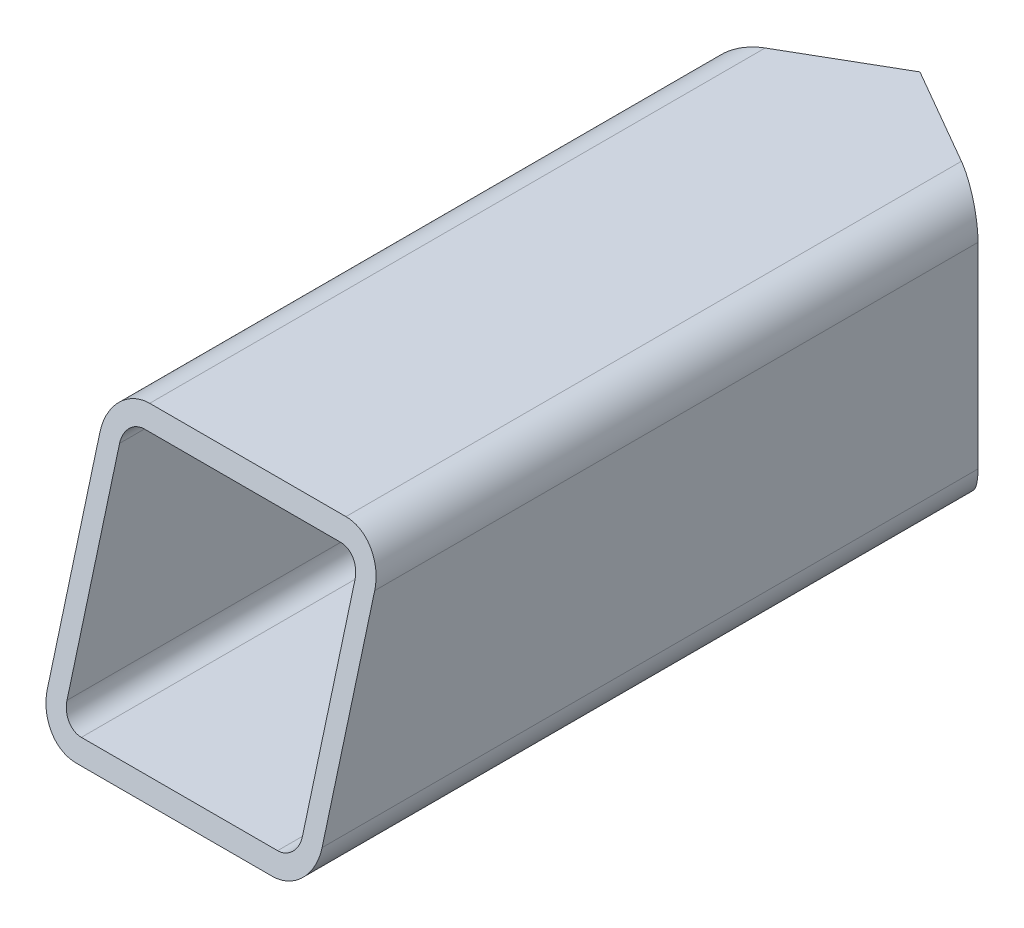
ISO-10303-21;
HEADER;
FILE_DESCRIPTION(('STEP AP214'),'2;1');
FILE_NAME('part.step','',(''),(''),'','','');
FILE_SCHEMA(('AUTOMOTIVE_DESIGN { 1 0 10303 214 1 1 1 1 }'));
ENDSEC;
DATA;
#1=APPLICATION_CONTEXT('core data for automotive mechanical design processes');
#2=APPLICATION_PROTOCOL_DEFINITION('international standard','automotive_design',2000,#1);
#3=PRODUCT_CONTEXT('',#1,'mechanical');
#4=PRODUCT('Part','Part','',(#3));
#5=PRODUCT_RELATED_PRODUCT_CATEGORY('part','',(#4));
#6=PRODUCT_DEFINITION_FORMATION('','',#4);
#7=PRODUCT_DEFINITION_CONTEXT('part definition',#1,'design');
#8=PRODUCT_DEFINITION('design','',#6,#7);
#9=PRODUCT_DEFINITION_SHAPE('','',#8);
#10=(LENGTH_UNIT() NAMED_UNIT(*) SI_UNIT(.MILLI.,.METRE.));
#11=(NAMED_UNIT(*) PLANE_ANGLE_UNIT() SI_UNIT($,.RADIAN.));
#12=(NAMED_UNIT(*) SI_UNIT($,.STERADIAN.) SOLID_ANGLE_UNIT());
#13=UNCERTAINTY_MEASURE_WITH_UNIT(LENGTH_MEASURE(1.E-05),#10,'distance_accuracy_value','');
#14=(GEOMETRIC_REPRESENTATION_CONTEXT(3) GLOBAL_UNCERTAINTY_ASSIGNED_CONTEXT((#13)) GLOBAL_UNIT_ASSIGNED_CONTEXT((#10,
#11,#12)) REPRESENTATION_CONTEXT('',''));
#15=CARTESIAN_POINT('',(0.,0.,0.));
#16=DIRECTION('',(0.,0.,1.));
#17=DIRECTION('',(1.,0.,0.));
#18=AXIS2_PLACEMENT_3D('',#15,#16,#17);
#19=CARTESIAN_POINT('',(-25.,25.,250.));
#20=DIRECTION('',(0.,0.,-1.));
#21=DIRECTION('',(-1.,0.,0.));
#22=AXIS2_PLACEMENT_3D('',#19,#20,#21);
#23=CYLINDRICAL_SURFACE('',#22,10.);
#24=DIRECTION('',(0.,0.,-1.));
#25=VECTOR('',#24,1.);
#26=CARTESIAN_POINT('',(-35.,25.,250.));
#27=LINE('',#26,#25);
#28=CARTESIAN_POINT('',(-35.,25.,173.923048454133));
#29=VERTEX_POINT('',#28);
#30=CARTESIAN_POINT('',(-35.,25.,20.207259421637));
#31=VERTEX_POINT('',#30);
#32=EDGE_CURVE('E176',#29,#31,#27,.T.);
#33=ORIENTED_EDGE('',*,*,#32,.F.);
#34=CARTESIAN_POINT('',(-25.,25.,173.923048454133));
#35=DIRECTION('',(0.,-0.258819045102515,-0.96592582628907));
#36=DIRECTION('',(0.,0.96592582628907,-0.258819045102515));
#37=AXIS2_PLACEMENT_3D('',#34,#35,#36);
#38=ELLIPSE('',#37,10.3527618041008,10.);
#39=CARTESIAN_POINT('',(-25.,35.,171.243556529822));
#40=VERTEX_POINT('',#39);
#41=EDGE_CURVE('E160',#29,#40,#38,.T.);
#42=ORIENTED_EDGE('',*,*,#41,.T.);
#43=DIRECTION('',(0.,0.,-1.));
#44=VECTOR('',#43,1.);
#45=CARTESIAN_POINT('',(-25.,35.,250.));
#46=LINE('',#45,#44);
#47=CARTESIAN_POINT('',(-25.,35.,14.4337567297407));
#48=VERTEX_POINT('',#47);
#49=EDGE_CURVE('E245',#40,#48,#46,.T.);
#50=ORIENTED_EDGE('',*,*,#49,.T.);
#51=CARTESIAN_POINT('',(-25.,25.,14.4337567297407));
#52=DIRECTION('',(-0.500000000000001,0.,-0.866025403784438));
#53=DIRECTION('',(0.866025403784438,0.,-0.500000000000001));
#54=AXIS2_PLACEMENT_3D('',#51,#52,#53);
#55=ELLIPSE('',#54,11.5470053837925,10.);
#56=EDGE_CURVE('E291',#31,#48,#55,.T.);
#57=ORIENTED_EDGE('',*,*,#56,.F.);
#58=EDGE_LOOP('',(#33,#42,#50,#57));
#59=FACE_BOUND('',#58,.T.);
#60=ADVANCED_FACE('F32',(#59),#23,.T.);
#61=CARTESIAN_POINT('',(-25.,-25.,250.));
#62=DIRECTION('',(0.,0.,-1.));
#63=DIRECTION('',(-1.,0.,0.));
#64=AXIS2_PLACEMENT_3D('',#61,#62,#63);
#65=CYLINDRICAL_SURFACE('',#64,10.);
#66=DIRECTION('',(0.,0.,-1.));
#67=VECTOR('',#66,1.);
#68=CARTESIAN_POINT('',(-25.,-35.,250.));
#69=LINE('',#68,#67);
#70=CARTESIAN_POINT('',(-25.,-35.,190.));
#71=VERTEX_POINT('',#70);
#72=CARTESIAN_POINT('',(-25.,-35.,14.4337567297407));
#73=VERTEX_POINT('',#72);
#74=EDGE_CURVE('E170',#71,#73,#69,.T.);
#75=ORIENTED_EDGE('',*,*,#74,.F.);
#76=CARTESIAN_POINT('',(-25.,-25.,187.320508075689));
#77=DIRECTION('',(0.,-0.258819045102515,-0.96592582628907));
#78=DIRECTION('',(0.,0.96592582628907,-0.258819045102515));
#79=AXIS2_PLACEMENT_3D('',#76,#77,#78);
#80=ELLIPSE('',#79,10.3527618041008,10.);
#81=CARTESIAN_POINT('',(-35.,-25.,187.320508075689));
#82=VERTEX_POINT('',#81);
#83=EDGE_CURVE('E157',#71,#82,#80,.T.);
#84=ORIENTED_EDGE('',*,*,#83,.T.);
#85=DIRECTION('',(0.,0.,-1.));
#86=VECTOR('',#85,1.);
#87=CARTESIAN_POINT('',(-35.,-25.,250.));
#88=LINE('',#87,#86);
#89=CARTESIAN_POINT('',(-35.,-25.,20.207259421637));
#90=VERTEX_POINT('',#89);
#91=EDGE_CURVE('E168',#82,#90,#88,.T.);
#92=ORIENTED_EDGE('',*,*,#91,.T.);
#93=CARTESIAN_POINT('',(-25.,-25.,14.4337567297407));
#94=DIRECTION('',(-0.500000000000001,0.,-0.866025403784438));
#95=DIRECTION('',(0.866025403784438,0.,-0.500000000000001));
#96=AXIS2_PLACEMENT_3D('',#93,#94,#95);
#97=ELLIPSE('',#96,11.5470053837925,10.);
#98=EDGE_CURVE('E207',#73,#90,#97,.T.);
#99=ORIENTED_EDGE('',*,*,#98,.F.);
#100=EDGE_LOOP('',(#75,#84,#92,#99));
#101=FACE_BOUND('',#100,.T.);
#102=ADVANCED_FACE('F166',(#101),#65,.T.);
#103=CARTESIAN_POINT('',(-25.,-35.,250.));
#104=DIRECTION('',(0.,1.,0.));
#105=DIRECTION('',(0.,0.,1.));
#106=AXIS2_PLACEMENT_3D('',#103,#104,#105);
#107=PLANE('',#106);
#108=DIRECTION('',(0.,0.,-1.));
#109=VECTOR('',#108,1.);
#110=CARTESIAN_POINT('',(25.,-35.,250.));
#111=LINE('',#110,#109);
#112=CARTESIAN_POINT('',(25.,-35.,190.));
#113=VERTEX_POINT('',#112);
#114=CARTESIAN_POINT('',(25.,-35.,14.4337567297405));
#115=VERTEX_POINT('',#114);
#116=EDGE_CURVE('E180',#113,#115,#111,.T.);
#117=ORIENTED_EDGE('',*,*,#116,.F.);
#118=DIRECTION('',(-1.,0.,0.));
#119=VECTOR('',#118,1.);
#120=CARTESIAN_POINT('',(-25.,-35.,190.));
#121=LINE('',#120,#119);
#122=EDGE_CURVE('E318',#113,#71,#121,.T.);
#123=ORIENTED_EDGE('',*,*,#122,.T.);
#124=ORIENTED_EDGE('',*,*,#74,.T.);
#125=DIRECTION('',(-0.866025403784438,0.,0.500000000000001));
#126=VECTOR('',#125,1.);
#127=CARTESIAN_POINT('',(-127.003175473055,-35.,73.3253175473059));
#128=LINE('',#127,#126);
#129=CARTESIAN_POINT('',(0.,-35.,0.));
#130=VERTEX_POINT('',#129);
#131=EDGE_CURVE('E211',#130,#73,#128,.T.);
#132=ORIENTED_EDGE('',*,*,#131,.F.);
#133=DIRECTION('',(-0.866025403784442,0.,-0.499999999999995));
#134=VECTOR('',#133,1.);
#135=CARTESIAN_POINT('',(89.5031754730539,-35.,51.6746824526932));
#136=LINE('',#135,#134);
#137=EDGE_CURVE('E227',#115,#130,#136,.T.);
#138=ORIENTED_EDGE('',*,*,#137,.F.);
#139=EDGE_LOOP('',(#117,#123,#124,#132,#138));
#140=FACE_BOUND('',#139,.T.);
#141=ADVANCED_FACE('F262',(#140),#107,.F.);
#142=CARTESIAN_POINT('',(25.,-25.,250.));
#143=DIRECTION('',(0.,0.,-1.));
#144=DIRECTION('',(-1.,0.,0.));
#145=AXIS2_PLACEMENT_3D('',#142,#143,#144);
#146=CYLINDRICAL_SURFACE('',#145,10.);
#147=DIRECTION('',(0.,0.,-1.));
#148=VECTOR('',#147,1.);
#149=CARTESIAN_POINT('',(35.,-25.,250.));
#150=LINE('',#149,#148);
#151=CARTESIAN_POINT('',(35.,-25.,187.320508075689));
#152=VERTEX_POINT('',#151);
#153=CARTESIAN_POINT('',(35.,-25.,20.2072594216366));
#154=VERTEX_POINT('',#153);
#155=EDGE_CURVE('E251',#152,#154,#150,.T.);
#156=ORIENTED_EDGE('',*,*,#155,.F.);
#157=CARTESIAN_POINT('',(25.,-25.,187.320508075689));
#158=DIRECTION('',(0.,-0.258819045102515,-0.96592582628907));
#159=DIRECTION('',(0.,0.96592582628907,-0.258819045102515));
#160=AXIS2_PLACEMENT_3D('',#157,#158,#159);
#161=ELLIPSE('',#160,10.3527618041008,10.);
#162=EDGE_CURVE('E260',#152,#113,#161,.T.);
#163=ORIENTED_EDGE('',*,*,#162,.T.);
#164=ORIENTED_EDGE('',*,*,#116,.T.);
#165=CARTESIAN_POINT('',(25.,-25.,14.4337567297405));
#166=DIRECTION('',(0.499999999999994,0.,-0.866025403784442));
#167=DIRECTION('',(-0.866025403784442,0.,-0.499999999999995));
#168=AXIS2_PLACEMENT_3D('',#165,#166,#167);
#169=ELLIPSE('',#168,11.5470053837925,10.);
#170=EDGE_CURVE('E225',#154,#115,#169,.T.);
#171=ORIENTED_EDGE('',*,*,#170,.F.);
#172=EDGE_LOOP('',(#156,#163,#164,#171));
#173=FACE_BOUND('',#172,.T.);
#174=ADVANCED_FACE('F258',(#173),#146,.T.);
#175=CARTESIAN_POINT('',(35.,25.,250.));
#176=DIRECTION('',(-1.,0.,0.));
#177=DIRECTION('',(0.,-1.,0.));
#178=AXIS2_PLACEMENT_3D('',#175,#176,#177);
#179=PLANE('',#178);
#180=DIRECTION('',(0.,0.,-1.));
#181=VECTOR('',#180,1.);
#182=CARTESIAN_POINT('',(35.,25.,250.));
#183=LINE('',#182,#181);
#184=CARTESIAN_POINT('',(35.,25.,173.923048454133));
#185=VERTEX_POINT('',#184);
#186=CARTESIAN_POINT('',(35.,25.,20.2072594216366));
#187=VERTEX_POINT('',#186);
#188=EDGE_CURVE('E249',#185,#187,#183,.T.);
#189=ORIENTED_EDGE('',*,*,#188,.F.);
#190=DIRECTION('',(0.,-0.96592582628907,0.258819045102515));
#191=VECTOR('',#190,1.);
#192=CARTESIAN_POINT('',(35.,5.98076211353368,179.019237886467));
#193=LINE('',#192,#191);
#194=EDGE_CURVE('E321',#185,#152,#193,.T.);
#195=ORIENTED_EDGE('',*,*,#194,.T.);
#196=ORIENTED_EDGE('',*,*,#155,.T.);
#197=DIRECTION('',(0.,-1.,0.));
#198=VECTOR('',#197,1.);
#199=CARTESIAN_POINT('',(34.9999999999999,383.608241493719,20.2072594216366));
#200=LINE('',#199,#198);
#201=EDGE_CURVE('E267',#187,#154,#200,.T.);
#202=ORIENTED_EDGE('',*,*,#201,.F.);
#203=EDGE_LOOP('',(#189,#195,#196,#202));
#204=FACE_BOUND('',#203,.T.);
#205=ADVANCED_FACE('F414',(#204),#179,.F.);
#206=CARTESIAN_POINT('',(25.,25.,250.));
#207=DIRECTION('',(0.,0.,-1.));
#208=DIRECTION('',(-1.,0.,0.));
#209=AXIS2_PLACEMENT_3D('',#206,#207,#208);
#210=CYLINDRICAL_SURFACE('',#209,10.);
#211=DIRECTION('',(0.,0.,-1.));
#212=VECTOR('',#211,1.);
#213=CARTESIAN_POINT('',(25.,35.,250.));
#214=LINE('',#213,#212);
#215=CARTESIAN_POINT('',(25.,35.,171.243556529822));
#216=VERTEX_POINT('',#215);
#217=CARTESIAN_POINT('',(25.,35.,14.4337567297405));
#218=VERTEX_POINT('',#217);
#219=EDGE_CURVE('E247',#216,#218,#214,.T.);
#220=ORIENTED_EDGE('',*,*,#219,.F.);
#221=CARTESIAN_POINT('',(25.,25.,173.923048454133));
#222=DIRECTION('',(0.,-0.258819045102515,-0.96592582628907));
#223=DIRECTION('',(0.,0.96592582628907,-0.258819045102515));
#224=AXIS2_PLACEMENT_3D('',#221,#222,#223);
#225=ELLIPSE('',#224,10.3527618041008,10.);
#226=EDGE_CURVE('E324',#216,#185,#225,.T.);
#227=ORIENTED_EDGE('',*,*,#226,.T.);
#228=ORIENTED_EDGE('',*,*,#188,.T.);
#229=CARTESIAN_POINT('',(25.,25.,14.4337567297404));
#230=DIRECTION('',(0.499999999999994,0.,-0.866025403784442));
#231=DIRECTION('',(-0.866025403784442,0.,-0.499999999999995));
#232=AXIS2_PLACEMENT_3D('',#229,#230,#231);
#233=ELLIPSE('',#232,11.5470053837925,10.);
#234=EDGE_CURVE('E222',#218,#187,#233,.T.);
#235=ORIENTED_EDGE('',*,*,#234,.F.);
#236=EDGE_LOOP('',(#220,#227,#228,#235));
#237=FACE_BOUND('',#236,.T.);
#238=ADVANCED_FACE('F422',(#237),#210,.T.);
#239=CARTESIAN_POINT('',(-25.,35.,250.));
#240=DIRECTION('',(0.,-1.,0.));
#241=DIRECTION('',(1.,0.,0.));
#242=AXIS2_PLACEMENT_3D('',#239,#240,#241);
#243=PLANE('',#242);
#244=ORIENTED_EDGE('',*,*,#49,.F.);
#245=DIRECTION('',(1.,0.,0.));
#246=VECTOR('',#245,1.);
#247=CARTESIAN_POINT('',(-25.,35.,171.243556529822));
#248=LINE('',#247,#246);
#249=EDGE_CURVE('E327',#40,#216,#248,.T.);
#250=ORIENTED_EDGE('',*,*,#249,.T.);
#251=ORIENTED_EDGE('',*,*,#219,.T.);
#252=DIRECTION('',(0.866025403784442,0.,0.499999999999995));
#253=VECTOR('',#252,1.);
#254=CARTESIAN_POINT('',(89.5031754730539,35.,51.6746824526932));
#255=LINE('',#254,#253);
#256=CARTESIAN_POINT('',(0.,35.0000000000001,0.));
#257=VERTEX_POINT('',#256);
#258=EDGE_CURVE('E220',#257,#218,#255,.T.);
#259=ORIENTED_EDGE('',*,*,#258,.F.);
#260=DIRECTION('',(0.866025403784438,0.,-0.500000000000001));
#261=VECTOR('',#260,1.);
#262=CARTESIAN_POINT('',(-127.003175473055,35.,73.3253175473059));
#263=LINE('',#262,#261);
#264=EDGE_CURVE('E288',#48,#257,#263,.T.);
#265=ORIENTED_EDGE('',*,*,#264,.F.);
#266=EDGE_LOOP('',(#244,#250,#251,#259,#265));
#267=FACE_BOUND('',#266,.T.);
#268=ADVANCED_FACE('F335',(#267),#243,.F.);
#269=CARTESIAN_POINT('',(-25.,25.,250.));
#270=DIRECTION('',(0.,0.,-1.));
#271=DIRECTION('',(-1.,0.,0.));
#272=AXIS2_PLACEMENT_3D('',#269,#270,#271);
#273=CYLINDRICAL_SURFACE('',#272,5.);
#274=CARTESIAN_POINT('',(-25.,25.,173.923048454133));
#275=DIRECTION('',(0.,-0.258819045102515,-0.96592582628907));
#276=DIRECTION('',(0.,0.96592582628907,-0.258819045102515));
#277=AXIS2_PLACEMENT_3D('',#274,#275,#276);
#278=ELLIPSE('',#277,5.17638090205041,5.);
#279=CARTESIAN_POINT('',(-30.,25.,173.923048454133));
#280=VERTEX_POINT('',#279);
#281=CARTESIAN_POINT('',(-25.,30.,172.583302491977));
#282=VERTEX_POINT('',#281);
#283=EDGE_CURVE('E46',#280,#282,#278,.T.);
#284=ORIENTED_EDGE('',*,*,#283,.F.);
#285=DIRECTION('',(0.,0.,-1.));
#286=VECTOR('',#285,1.);
#287=CARTESIAN_POINT('',(-30.,25.,250.));
#288=LINE('',#287,#286);
#289=CARTESIAN_POINT('',(-30.,25.,17.3205080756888));
#290=VERTEX_POINT('',#289);
#291=EDGE_CURVE('E243',#280,#290,#288,.T.);
#292=ORIENTED_EDGE('',*,*,#291,.T.);
#293=CARTESIAN_POINT('',(-25.,25.,14.4337567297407));
#294=DIRECTION('',(-0.500000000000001,0.,-0.866025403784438));
#295=DIRECTION('',(0.866025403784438,0.,-0.500000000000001));
#296=AXIS2_PLACEMENT_3D('',#293,#294,#295);
#297=ELLIPSE('',#296,5.77350269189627,5.);
#298=CARTESIAN_POINT('',(-25.,30.,14.4337567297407));
#299=VERTEX_POINT('',#298);
#300=EDGE_CURVE('E271',#290,#299,#297,.T.);
#301=ORIENTED_EDGE('',*,*,#300,.T.);
#302=DIRECTION('',(0.,0.,-1.));
#303=VECTOR('',#302,1.);
#304=CARTESIAN_POINT('',(-25.,30.,250.));
#305=LINE('',#304,#303);
#306=EDGE_CURVE('E230',#282,#299,#305,.T.);
#307=ORIENTED_EDGE('',*,*,#306,.F.);
#308=EDGE_LOOP('',(#284,#292,#301,#307));
#309=FACE_BOUND('',#308,.T.);
#310=ADVANCED_FACE('F339',(#309),#273,.F.);
#311=CARTESIAN_POINT('',(-30.,25.,250.));
#312=DIRECTION('',(1.,0.,0.));
#313=DIRECTION('',(0.,1.,0.));
#314=AXIS2_PLACEMENT_3D('',#311,#312,#313);
#315=PLANE('',#314);
#316=DIRECTION('',(0.,0.96592582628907,-0.258819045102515));
#317=VECTOR('',#316,1.);
#318=CARTESIAN_POINT('',(-30.,5.98076211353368,179.019237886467));
#319=LINE('',#318,#317);
#320=CARTESIAN_POINT('',(-30.,-25.,187.320508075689));
#321=VERTEX_POINT('',#320);
#322=EDGE_CURVE('E53',#321,#280,#319,.T.);
#323=ORIENTED_EDGE('',*,*,#322,.F.);
#324=DIRECTION('',(0.,0.,-1.));
#325=VECTOR('',#324,1.);
#326=CARTESIAN_POINT('',(-30.,-25.,250.));
#327=LINE('',#326,#325);
#328=CARTESIAN_POINT('',(-30.,-25.,17.3205080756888));
#329=VERTEX_POINT('',#328);
#330=EDGE_CURVE('E241',#321,#329,#327,.T.);
#331=ORIENTED_EDGE('',*,*,#330,.T.);
#332=DIRECTION('',(0.,1.,0.));
#333=VECTOR('',#332,1.);
#334=CARTESIAN_POINT('',(-30.,24.9999999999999,17.3205080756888));
#335=LINE('',#334,#333);
#336=EDGE_CURVE('E274',#329,#290,#335,.T.);
#337=ORIENTED_EDGE('',*,*,#336,.T.);
#338=ORIENTED_EDGE('',*,*,#291,.F.);
#339=EDGE_LOOP('',(#323,#331,#337,#338));
#340=FACE_BOUND('',#339,.T.);
#341=ADVANCED_FACE('F340',(#340),#315,.T.);
#342=CARTESIAN_POINT('',(-25.,-25.,250.));
#343=DIRECTION('',(0.,0.,-1.));
#344=DIRECTION('',(-1.,0.,0.));
#345=AXIS2_PLACEMENT_3D('',#342,#343,#344);
#346=CYLINDRICAL_SURFACE('',#345,5.);
#347=CARTESIAN_POINT('',(-25.,-25.,187.320508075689));
#348=DIRECTION('',(0.,-0.258819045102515,-0.96592582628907));
#349=DIRECTION('',(0.,0.96592582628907,-0.258819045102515));
#350=AXIS2_PLACEMENT_3D('',#347,#348,#349);
#351=ELLIPSE('',#350,5.17638090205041,5.);
#352=CARTESIAN_POINT('',(-25.,-30.,188.660254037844));
#353=VERTEX_POINT('',#352);
#354=EDGE_CURVE('E300',#353,#321,#351,.T.);
#355=ORIENTED_EDGE('',*,*,#354,.F.);
#356=DIRECTION('',(0.,0.,-1.));
#357=VECTOR('',#356,1.);
#358=CARTESIAN_POINT('',(-25.,-30.,250.));
#359=LINE('',#358,#357);
#360=CARTESIAN_POINT('',(-25.,-30.,14.4337567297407));
#361=VERTEX_POINT('',#360);
#362=EDGE_CURVE('E239',#353,#361,#359,.T.);
#363=ORIENTED_EDGE('',*,*,#362,.T.);
#364=CARTESIAN_POINT('',(-25.,-25.,14.4337567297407));
#365=DIRECTION('',(-0.500000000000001,0.,-0.866025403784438));
#366=DIRECTION('',(0.866025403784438,0.,-0.500000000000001));
#367=AXIS2_PLACEMENT_3D('',#364,#365,#366);
#368=ELLIPSE('',#367,5.77350269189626,5.);
#369=EDGE_CURVE('E282',#361,#329,#368,.T.);
#370=ORIENTED_EDGE('',*,*,#369,.T.);
#371=ORIENTED_EDGE('',*,*,#330,.F.);
#372=EDGE_LOOP('',(#355,#363,#370,#371));
#373=FACE_BOUND('',#372,.T.);
#374=ADVANCED_FACE('F344',(#373),#346,.F.);
#375=CARTESIAN_POINT('',(-25.,-30.,250.));
#376=DIRECTION('',(0.,1.,0.));
#377=DIRECTION('',(-1.,0.,0.));
#378=AXIS2_PLACEMENT_3D('',#375,#376,#377);
#379=PLANE('',#378);
#380=DIRECTION('',(-1.,0.,0.));
#381=VECTOR('',#380,1.);
#382=CARTESIAN_POINT('',(-25.,-30.,188.660254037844));
#383=LINE('',#382,#381);
#384=CARTESIAN_POINT('',(25.,-30.,188.660254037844));
#385=VERTEX_POINT('',#384);
#386=EDGE_CURVE('E303',#385,#353,#383,.T.);
#387=ORIENTED_EDGE('',*,*,#386,.F.);
#388=DIRECTION('',(0.,0.,-1.));
#389=VECTOR('',#388,1.);
#390=CARTESIAN_POINT('',(25.,-30.,250.));
#391=LINE('',#390,#389);
#392=CARTESIAN_POINT('',(25.,-30.,14.4337567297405));
#393=VERTEX_POINT('',#392);
#394=EDGE_CURVE('E237',#385,#393,#391,.T.);
#395=ORIENTED_EDGE('',*,*,#394,.T.);
#396=DIRECTION('',(-0.866025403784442,0.,-0.499999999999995));
#397=VECTOR('',#396,1.);
#398=CARTESIAN_POINT('',(89.5031754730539,-30.,51.6746824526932));
#399=LINE('',#398,#397);
#400=CARTESIAN_POINT('',(0.,-29.9999999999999,0.));
#401=VERTEX_POINT('',#400);
#402=EDGE_CURVE('E217',#393,#401,#399,.T.);
#403=ORIENTED_EDGE('',*,*,#402,.T.);
#404=DIRECTION('',(-0.866025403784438,0.,0.500000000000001));
#405=VECTOR('',#404,1.);
#406=CARTESIAN_POINT('',(-127.003175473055,-30.,73.3253175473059));
#407=LINE('',#406,#405);
#408=EDGE_CURVE('E285',#401,#361,#407,.T.);
#409=ORIENTED_EDGE('',*,*,#408,.T.);
#410=ORIENTED_EDGE('',*,*,#362,.F.);
#411=EDGE_LOOP('',(#387,#395,#403,#409,#410));
#412=FACE_BOUND('',#411,.T.);
#413=ADVANCED_FACE('F346',(#412),#379,.T.);
#414=CARTESIAN_POINT('',(25.,-25.,250.));
#415=DIRECTION('',(0.,0.,-1.));
#416=DIRECTION('',(-1.,0.,0.));
#417=AXIS2_PLACEMENT_3D('',#414,#415,#416);
#418=CYLINDRICAL_SURFACE('',#417,5.);
#419=CARTESIAN_POINT('',(25.,-25.,187.320508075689));
#420=DIRECTION('',(0.,-0.258819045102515,-0.96592582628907));
#421=DIRECTION('',(0.,0.96592582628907,-0.258819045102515));
#422=AXIS2_PLACEMENT_3D('',#419,#420,#421);
#423=ELLIPSE('',#422,5.17638090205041,5.);
#424=CARTESIAN_POINT('',(30.,-25.,187.320508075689));
#425=VERTEX_POINT('',#424);
#426=EDGE_CURVE('E306',#425,#385,#423,.T.);
#427=ORIENTED_EDGE('',*,*,#426,.F.);
#428=DIRECTION('',(0.,0.,-1.));
#429=VECTOR('',#428,1.);
#430=CARTESIAN_POINT('',(30.,-25.,250.));
#431=LINE('',#430,#429);
#432=CARTESIAN_POINT('',(30.,-25.,17.3205080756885));
#433=VERTEX_POINT('',#432);
#434=EDGE_CURVE('E235',#425,#433,#431,.T.);
#435=ORIENTED_EDGE('',*,*,#434,.T.);
#436=CARTESIAN_POINT('',(25.,-25.,14.4337567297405));
#437=DIRECTION('',(0.499999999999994,0.,-0.866025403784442));
#438=DIRECTION('',(-0.866025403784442,0.,-0.499999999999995));
#439=AXIS2_PLACEMENT_3D('',#436,#437,#438);
#440=ELLIPSE('',#439,5.77350269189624,5.);
#441=EDGE_CURVE('E209',#433,#393,#440,.T.);
#442=ORIENTED_EDGE('',*,*,#441,.T.);
#443=ORIENTED_EDGE('',*,*,#394,.F.);
#444=EDGE_LOOP('',(#427,#435,#442,#443));
#445=FACE_BOUND('',#444,.T.);
#446=ADVANCED_FACE('F349',(#445),#418,.F.);
#447=CARTESIAN_POINT('',(30.,25.,250.));
#448=DIRECTION('',(-1.,0.,0.));
#449=DIRECTION('',(0.,-1.,0.));
#450=AXIS2_PLACEMENT_3D('',#447,#448,#449);
#451=PLANE('',#450);
#452=DIRECTION('',(0.,-0.96592582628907,0.258819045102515));
#453=VECTOR('',#452,1.);
#454=CARTESIAN_POINT('',(30.,5.98076211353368,179.019237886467));
#455=LINE('',#454,#453);
#456=CARTESIAN_POINT('',(30.,25.,173.923048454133));
#457=VERTEX_POINT('',#456);
#458=EDGE_CURVE('E309',#457,#425,#455,.T.);
#459=ORIENTED_EDGE('',*,*,#458,.F.);
#460=DIRECTION('',(0.,0.,-1.));
#461=VECTOR('',#460,1.);
#462=CARTESIAN_POINT('',(30.,25.,250.));
#463=LINE('',#462,#461);
#464=CARTESIAN_POINT('',(30.,25.,17.3205080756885));
#465=VERTEX_POINT('',#464);
#466=EDGE_CURVE('E233',#457,#465,#463,.T.);
#467=ORIENTED_EDGE('',*,*,#466,.T.);
#468=DIRECTION('',(0.,-1.,0.));
#469=VECTOR('',#468,1.);
#470=CARTESIAN_POINT('',(30.,25.,17.3205080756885));
#471=LINE('',#470,#469);
#472=EDGE_CURVE('E204',#465,#433,#471,.T.);
#473=ORIENTED_EDGE('',*,*,#472,.T.);
#474=ORIENTED_EDGE('',*,*,#434,.F.);
#475=EDGE_LOOP('',(#459,#467,#473,#474));
#476=FACE_BOUND('',#475,.T.);
#477=ADVANCED_FACE('F352',(#476),#451,.T.);
#478=CARTESIAN_POINT('',(25.,25.,250.));
#479=DIRECTION('',(0.,0.,-1.));
#480=DIRECTION('',(-1.,0.,0.));
#481=AXIS2_PLACEMENT_3D('',#478,#479,#480);
#482=CYLINDRICAL_SURFACE('',#481,5.);
#483=CARTESIAN_POINT('',(25.,25.,173.923048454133));
#484=DIRECTION('',(0.,-0.258819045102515,-0.96592582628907));
#485=DIRECTION('',(0.,0.96592582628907,-0.258819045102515));
#486=AXIS2_PLACEMENT_3D('',#483,#484,#485);
#487=ELLIPSE('',#486,5.17638090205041,5.);
#488=CARTESIAN_POINT('',(25.,30.,172.583302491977));
#489=VERTEX_POINT('',#488);
#490=EDGE_CURVE('E312',#489,#457,#487,.T.);
#491=ORIENTED_EDGE('',*,*,#490,.F.);
#492=DIRECTION('',(0.,0.,-1.));
#493=VECTOR('',#492,1.);
#494=CARTESIAN_POINT('',(25.,30.,250.));
#495=LINE('',#494,#493);
#496=CARTESIAN_POINT('',(25.,30.,14.4337567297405));
#497=VERTEX_POINT('',#496);
#498=EDGE_CURVE('E189',#489,#497,#495,.T.);
#499=ORIENTED_EDGE('',*,*,#498,.T.);
#500=CARTESIAN_POINT('',(25.,25.,14.4337567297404));
#501=DIRECTION('',(0.499999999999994,0.,-0.866025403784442));
#502=DIRECTION('',(-0.866025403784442,0.,-0.499999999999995));
#503=AXIS2_PLACEMENT_3D('',#500,#501,#502);
#504=ELLIPSE('',#503,5.77350269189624,5.);
#505=EDGE_CURVE('E201',#497,#465,#504,.T.);
#506=ORIENTED_EDGE('',*,*,#505,.T.);
#507=ORIENTED_EDGE('',*,*,#466,.F.);
#508=EDGE_LOOP('',(#491,#499,#506,#507));
#509=FACE_BOUND('',#508,.T.);
#510=ADVANCED_FACE('F353',(#509),#482,.F.);
#511=CARTESIAN_POINT('',(-25.,30.,250.));
#512=DIRECTION('',(0.,-1.,0.));
#513=DIRECTION('',(0.,0.,-1.));
#514=AXIS2_PLACEMENT_3D('',#511,#512,#513);
#515=PLANE('',#514);
#516=DIRECTION('',(1.,0.,0.));
#517=VECTOR('',#516,1.);
#518=CARTESIAN_POINT('',(-25.,30.,172.583302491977));
#519=LINE('',#518,#517);
#520=EDGE_CURVE('E315',#282,#489,#519,.T.);
#521=ORIENTED_EDGE('',*,*,#520,.F.);
#522=ORIENTED_EDGE('',*,*,#306,.T.);
#523=DIRECTION('',(0.866025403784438,0.,-0.500000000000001));
#524=VECTOR('',#523,1.);
#525=CARTESIAN_POINT('',(-127.003175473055,30.,73.3253175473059));
#526=LINE('',#525,#524);
#527=CARTESIAN_POINT('',(0.,30.,0.));
#528=VERTEX_POINT('',#527);
#529=EDGE_CURVE('E178',#299,#528,#526,.T.);
#530=ORIENTED_EDGE('',*,*,#529,.T.);
#531=DIRECTION('',(0.866025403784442,0.,0.499999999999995));
#532=VECTOR('',#531,1.);
#533=CARTESIAN_POINT('',(89.5031754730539,30.,51.6746824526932));
#534=LINE('',#533,#532);
#535=EDGE_CURVE('E39',#528,#497,#534,.T.);
#536=ORIENTED_EDGE('',*,*,#535,.T.);
#537=ORIENTED_EDGE('',*,*,#498,.F.);
#538=EDGE_LOOP('',(#521,#522,#530,#536,#537));
#539=FACE_BOUND('',#538,.T.);
#540=ADVANCED_FACE('F188',(#539),#515,.T.);
#541=CARTESIAN_POINT('',(-35.,25.,250.));
#542=DIRECTION('',(1.,0.,0.));
#543=DIRECTION('',(0.,1.,0.));
#544=AXIS2_PLACEMENT_3D('',#541,#542,#543);
#545=PLANE('',#544);
#546=ORIENTED_EDGE('',*,*,#91,.F.);
#547=DIRECTION('',(0.,0.96592582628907,-0.258819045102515));
#548=VECTOR('',#547,1.);
#549=CARTESIAN_POINT('',(-35.,5.98076211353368,179.019237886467));
#550=LINE('',#549,#548);
#551=EDGE_CURVE('E11',#82,#29,#550,.T.);
#552=ORIENTED_EDGE('',*,*,#551,.T.);
#553=ORIENTED_EDGE('',*,*,#32,.T.);
#554=DIRECTION('',(0.,-1.,0.));
#555=VECTOR('',#554,1.);
#556=CARTESIAN_POINT('',(-35.0000000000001,383.608241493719,20.207259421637));
#557=LINE('',#556,#555);
#558=EDGE_CURVE('E174',#31,#90,#557,.T.);
#559=ORIENTED_EDGE('',*,*,#558,.T.);
#560=EDGE_LOOP('',(#546,#552,#553,#559));
#561=FACE_BOUND('',#560,.T.);
#562=ADVANCED_FACE('F172',(#561),#545,.F.);
#563=CARTESIAN_POINT('',(-1.06472675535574E-13,383.608241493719,0.));
#564=DIRECTION('',(0.499999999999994,0.,-0.866025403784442));
#565=DIRECTION('',(-0.866025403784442,0.,-0.499999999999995));
#566=AXIS2_PLACEMENT_3D('',#563,#564,#565);
#567=PLANE('',#566);
#568=ORIENTED_EDGE('',*,*,#170,.T.);
#569=ORIENTED_EDGE('',*,*,#137,.T.);
#570=DIRECTION('',(0.,-1.,0.));
#571=VECTOR('',#570,1.);
#572=CARTESIAN_POINT('',(-1.06472675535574E-13,383.608241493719,0.));
#573=LINE('',#572,#571);
#574=EDGE_CURVE('E276',#401,#130,#573,.T.);
#575=ORIENTED_EDGE('',*,*,#574,.F.);
#576=ORIENTED_EDGE('',*,*,#402,.F.);
#577=ORIENTED_EDGE('',*,*,#441,.F.);
#578=ORIENTED_EDGE('',*,*,#472,.F.);
#579=ORIENTED_EDGE('',*,*,#505,.F.);
#580=ORIENTED_EDGE('',*,*,#535,.F.);
#581=EDGE_CURVE('E198',#257,#528,#573,.T.);
#582=ORIENTED_EDGE('',*,*,#581,.F.);
#583=ORIENTED_EDGE('',*,*,#258,.T.);
#584=ORIENTED_EDGE('',*,*,#234,.T.);
#585=ORIENTED_EDGE('',*,*,#201,.T.);
#586=EDGE_LOOP('',(#568,#569,#575,#576,#577,#578,#579,#580,#582,#583,#584,#585));
#587=FACE_BOUND('',#586,.T.);
#588=ADVANCED_FACE('F196',(#587),#567,.T.);
#589=CARTESIAN_POINT('',(-1.06472675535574E-13,383.608241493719,0.));
#590=DIRECTION('',(-0.500000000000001,0.,-0.866025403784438));
#591=DIRECTION('',(-0.866025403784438,0.,0.500000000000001));
#592=AXIS2_PLACEMENT_3D('',#589,#590,#591);
#593=PLANE('',#592);
#594=ORIENTED_EDGE('',*,*,#131,.T.);
#595=ORIENTED_EDGE('',*,*,#98,.T.);
#596=ORIENTED_EDGE('',*,*,#558,.F.);
#597=ORIENTED_EDGE('',*,*,#56,.T.);
#598=ORIENTED_EDGE('',*,*,#264,.T.);
#599=ORIENTED_EDGE('',*,*,#581,.T.);
#600=ORIENTED_EDGE('',*,*,#529,.F.);
#601=ORIENTED_EDGE('',*,*,#300,.F.);
#602=ORIENTED_EDGE('',*,*,#336,.F.);
#603=ORIENTED_EDGE('',*,*,#369,.F.);
#604=ORIENTED_EDGE('',*,*,#408,.F.);
#605=ORIENTED_EDGE('',*,*,#574,.T.);
#606=EDGE_LOOP('',(#594,#595,#596,#597,#598,#599,#600,#601,#602,#603,#604,#605));
#607=FACE_BOUND('',#606,.T.);
#608=ADVANCED_FACE('F294',(#607),#593,.T.);
#609=CARTESIAN_POINT('',(-371.108241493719,-258.923048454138,250.));
#610=DIRECTION('',(0.,-0.258819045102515,-0.96592582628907));
#611=DIRECTION('',(0.,0.96592582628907,-0.258819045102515));
#612=AXIS2_PLACEMENT_3D('',#609,#610,#611);
#613=PLANE('',#612);
#614=ORIENTED_EDGE('',*,*,#322,.T.);
#615=ORIENTED_EDGE('',*,*,#283,.T.);
#616=ORIENTED_EDGE('',*,*,#520,.T.);
#617=ORIENTED_EDGE('',*,*,#490,.T.);
#618=ORIENTED_EDGE('',*,*,#458,.T.);
#619=ORIENTED_EDGE('',*,*,#426,.T.);
#620=ORIENTED_EDGE('',*,*,#386,.T.);
#621=ORIENTED_EDGE('',*,*,#354,.T.);
#622=EDGE_LOOP('',(#614,#615,#616,#617,#618,#619,#620,#621));
#623=FACE_BOUND('',#622,.T.);
#624=ORIENTED_EDGE('',*,*,#122,.F.);
#625=ORIENTED_EDGE('',*,*,#162,.F.);
#626=ORIENTED_EDGE('',*,*,#194,.F.);
#627=ORIENTED_EDGE('',*,*,#226,.F.);
#628=ORIENTED_EDGE('',*,*,#249,.F.);
#629=ORIENTED_EDGE('',*,*,#41,.F.);
#630=ORIENTED_EDGE('',*,*,#551,.F.);
#631=ORIENTED_EDGE('',*,*,#83,.F.);
#632=EDGE_LOOP('',(#624,#625,#626,#627,#628,#629,#630,#631));
#633=FACE_BOUND('',#632,.T.);
#634=ADVANCED_FACE('F156',(#623,#633),#613,.F.);
#635=CLOSED_SHELL('',(#60,#102,#141,#174,#205,#238,#268,#310,#341,#374,#413,#446,#477,#510,#540,
#562,#588,#608,#634));
#636=MANIFOLD_SOLID_BREP('B2',#635);
#637=ADVANCED_BREP_SHAPE_REPRESENTATION('',(#18,#636),#14);
#638=SHAPE_DEFINITION_REPRESENTATION(#9,#637);
ENDSEC;
END-ISO-10303-21;
